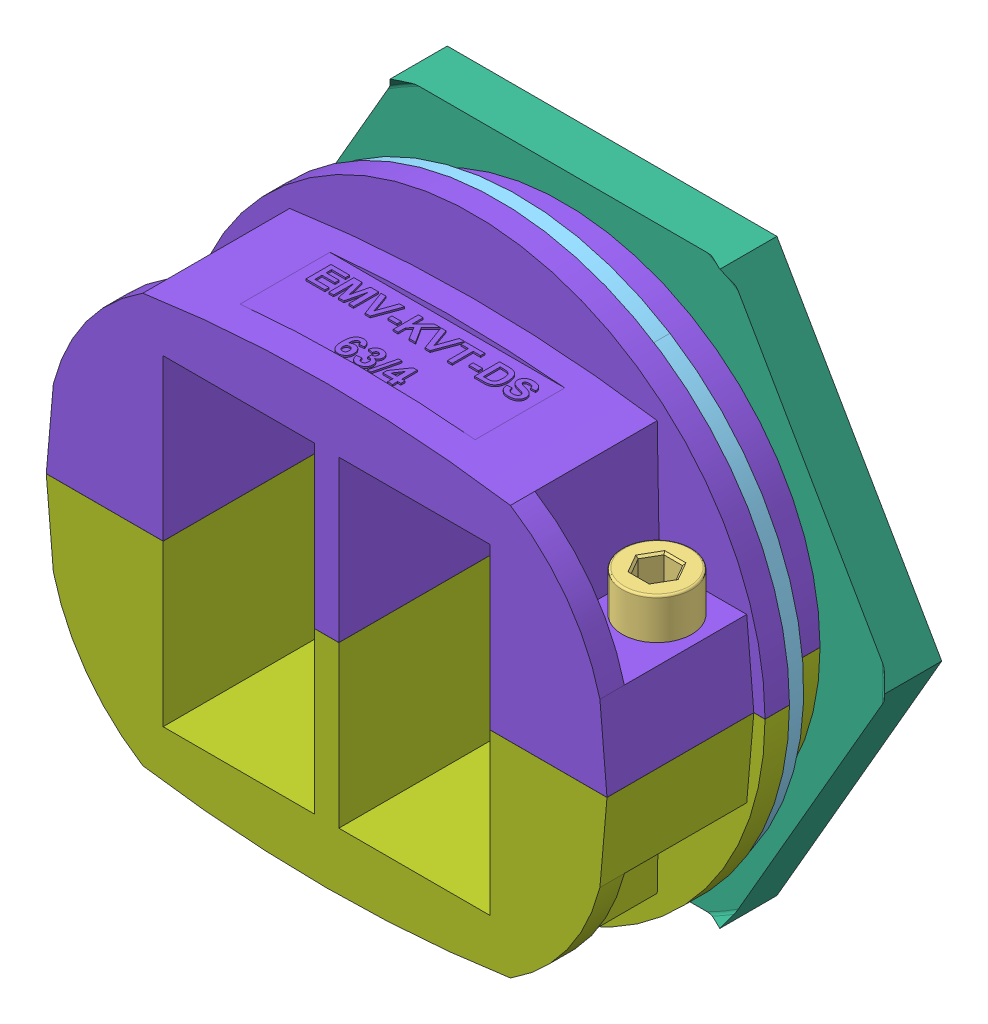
SolidWorks assembly 99437.SLDASM, configuration Default (file format 8000). Lengths in mm.
Overall size (80.83 71.5 35).
8 component instances, 8 part files, 0 mates.
Components (placement in the parent):
- 99437_01-1: 99437_01.SLDPRT [Default] at origin size (8.9 4.7 8.97)
- 99437_02-1: 99437_02.SLDPRT [Default] at origin size (8.01 4.7 9.25)
- 99437_03-1: 99437_03.SLDPRT [Default] at origin size (8.5 25 8.5)
- 99437_04-1: 99437_04.SLDPRT [Default] at origin size (8.5 25 8.5)
- 99437_05-1: 99437_05.SLDPRT [Default] at origin size (70 70 2.5)
- 99437_06-1: 99437_06.SLDPRT [Default] at origin size (80.83 70.64 7)
- 99437_07-1: 99437_07.SLDPRT [Default] at origin size (71.5 35.74 35)
- 99437_08-1: 99437_08.SLDPRT [Default] at origin size (71.5 35.74 35)
